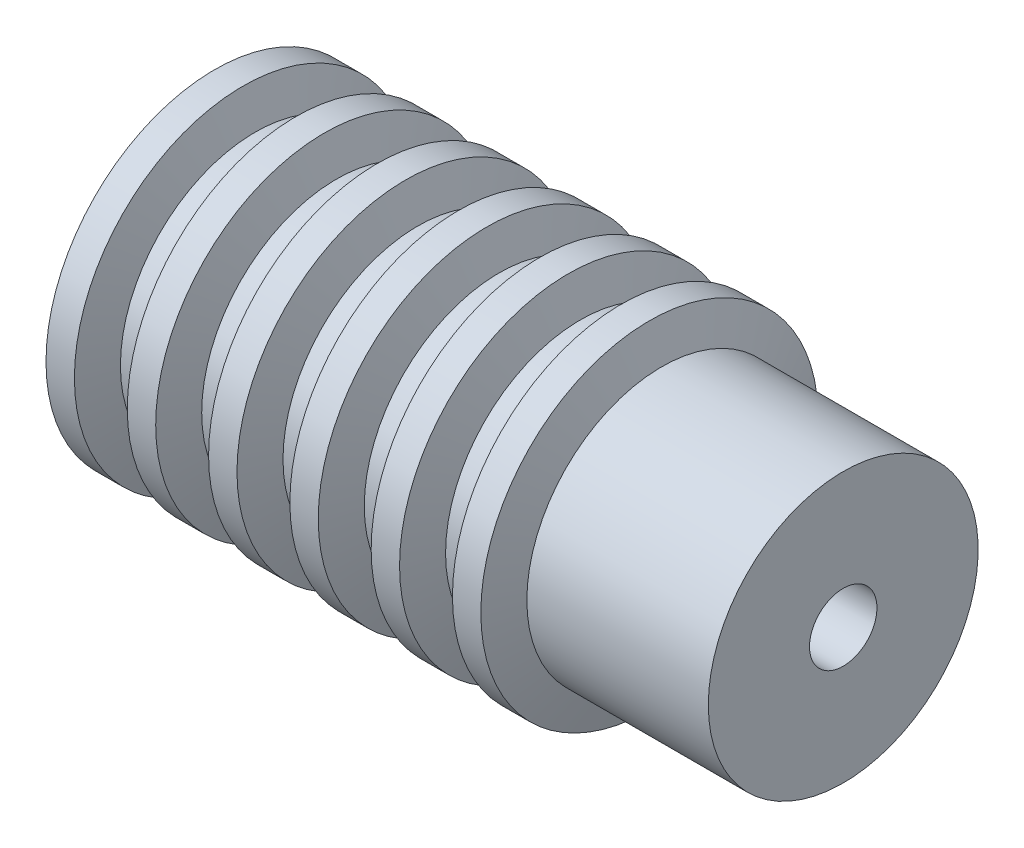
ISO-10303-21;
HEADER;
FILE_DESCRIPTION(('STEP AP214'),'2;1');
FILE_NAME('part.step','',(''),(''),'','','');
FILE_SCHEMA(('AUTOMOTIVE_DESIGN { 1 0 10303 214 1 1 1 1 }'));
ENDSEC;
DATA;
#1=APPLICATION_CONTEXT('core data for automotive mechanical design processes');
#2=APPLICATION_PROTOCOL_DEFINITION('international standard','automotive_design',2000,#1);
#3=PRODUCT_CONTEXT('',#1,'mechanical');
#4=PRODUCT('Part','Part','',(#3));
#5=PRODUCT_RELATED_PRODUCT_CATEGORY('part','',(#4));
#6=PRODUCT_DEFINITION_FORMATION('','',#4);
#7=PRODUCT_DEFINITION_CONTEXT('part definition',#1,'design');
#8=PRODUCT_DEFINITION('design','',#6,#7);
#9=PRODUCT_DEFINITION_SHAPE('','',#8);
#10=(LENGTH_UNIT() NAMED_UNIT(*) SI_UNIT(.MILLI.,.METRE.));
#11=(NAMED_UNIT(*) PLANE_ANGLE_UNIT() SI_UNIT($,.RADIAN.));
#12=(NAMED_UNIT(*) SI_UNIT($,.STERADIAN.) SOLID_ANGLE_UNIT());
#13=UNCERTAINTY_MEASURE_WITH_UNIT(LENGTH_MEASURE(1.E-05),#10,'distance_accuracy_value','');
#14=(GEOMETRIC_REPRESENTATION_CONTEXT(3) GLOBAL_UNCERTAINTY_ASSIGNED_CONTEXT((#13)) GLOBAL_UNIT_ASSIGNED_CONTEXT((#10,
#11,#12)) REPRESENTATION_CONTEXT('',''));
#15=CARTESIAN_POINT('',(0.,0.,0.));
#16=DIRECTION('',(0.,0.,1.));
#17=DIRECTION('',(1.,0.,0.));
#18=AXIS2_PLACEMENT_3D('',#15,#16,#17);
#19=CARTESIAN_POINT('',(0.,0.,0.));
#20=DIRECTION('',(-1.,0.,0.));
#21=DIRECTION('',(0.,0.,1.));
#22=AXIS2_PLACEMENT_3D('',#19,#20,#21);
#23=CYLINDRICAL_SURFACE('',#22,4.);
#24=CARTESIAN_POINT('',(19.,0.,0.));
#25=DIRECTION('',(-1.,0.,0.));
#26=DIRECTION('',(0.,0.,1.));
#27=AXIS2_PLACEMENT_3D('',#24,#25,#26);
#28=CIRCLE('',#27,4.);
#29=CARTESIAN_POINT('',(19.,0.,4.));
#30=VERTEX_POINT('',#29);
#31=EDGE_CURVE('E113',#30,#30,#28,.T.);
#32=ORIENTED_EDGE('',*,*,#31,.T.);
#33=EDGE_LOOP('',(#32));
#34=FACE_BOUND('',#33,.T.);
#35=CARTESIAN_POINT('',(13.62,0.,0.));
#36=DIRECTION('',(-1.,0.,0.));
#37=DIRECTION('',(0.,0.,1.));
#38=AXIS2_PLACEMENT_3D('',#35,#36,#37);
#39=CIRCLE('',#38,4.);
#40=CARTESIAN_POINT('',(13.62,0.,4.));
#41=VERTEX_POINT('',#40);
#42=EDGE_CURVE('E10',#41,#41,#39,.T.);
#43=ORIENTED_EDGE('',*,*,#42,.F.);
#44=EDGE_LOOP('',(#43));
#45=FACE_BOUND('',#44,.T.);
#46=ADVANCED_FACE('F28',(#34,#45),#23,.T.);
#47=CARTESIAN_POINT('',(13.62,0.,0.));
#48=DIRECTION('',(-1.,0.,0.));
#49=DIRECTION('',(0.,0.,1.));
#50=AXIS2_PLACEMENT_3D('',#47,#48,#49);
#51=CONICAL_SURFACE('',#50,4.,1.22173047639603);
#52=CARTESIAN_POINT('',(13.2560297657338,0.,0.));
#53=DIRECTION('',(-1.,0.,0.));
#54=DIRECTION('',(0.,0.,1.));
#55=AXIS2_PLACEMENT_3D('',#52,#53,#54);
#56=CIRCLE('',#55,5.00000000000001);
#57=CARTESIAN_POINT('',(13.2560297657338,0.,5.00000000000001));
#58=VERTEX_POINT('',#57);
#59=EDGE_CURVE('E34',#58,#58,#56,.T.);
#60=ORIENTED_EDGE('',*,*,#59,.F.);
#61=EDGE_LOOP('',(#60));
#62=FACE_BOUND('',#61,.T.);
#63=ORIENTED_EDGE('',*,*,#42,.T.);
#64=EDGE_LOOP('',(#63));
#65=FACE_BOUND('',#64,.T.);
#66=ADVANCED_FACE('F149',(#62,#65),#51,.T.);
#67=CARTESIAN_POINT('',(0.,0.,0.));
#68=DIRECTION('',(-1.,0.,0.));
#69=DIRECTION('',(0.,0.,1.));
#70=AXIS2_PLACEMENT_3D('',#67,#68,#69);
#71=CYLINDRICAL_SURFACE('',#70,5.00000000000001);
#72=CARTESIAN_POINT('',(12.4139702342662,0.,0.));
#73=DIRECTION('',(-1.,0.,0.));
#74=DIRECTION('',(0.,0.,1.));
#75=AXIS2_PLACEMENT_3D('',#72,#73,#74);
#76=CIRCLE('',#75,5.00000000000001);
#77=CARTESIAN_POINT('',(12.4139702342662,0.,5.00000000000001));
#78=VERTEX_POINT('',#77);
#79=EDGE_CURVE('E38',#78,#78,#76,.T.);
#80=ORIENTED_EDGE('',*,*,#79,.F.);
#81=EDGE_LOOP('',(#80));
#82=FACE_BOUND('',#81,.T.);
#83=ORIENTED_EDGE('',*,*,#59,.T.);
#84=EDGE_LOOP('',(#83));
#85=FACE_BOUND('',#84,.T.);
#86=ADVANCED_FACE('F153',(#82,#85),#71,.T.);
#87=CARTESIAN_POINT('',(12.05,0.,0.));
#88=DIRECTION('',(1.,0.,0.));
#89=DIRECTION('',(0.,0.,-1.));
#90=AXIS2_PLACEMENT_3D('',#87,#88,#89);
#91=CONICAL_SURFACE('',#90,4.,1.22173047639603);
#92=ORIENTED_EDGE('',*,*,#79,.T.);
#93=EDGE_LOOP('',(#92));
#94=FACE_BOUND('',#93,.T.);
#95=CARTESIAN_POINT('',(12.05,0.,0.));
#96=DIRECTION('',(-1.,0.,0.));
#97=DIRECTION('',(0.,0.,1.));
#98=AXIS2_PLACEMENT_3D('',#95,#96,#97);
#99=CIRCLE('',#98,4.);
#100=CARTESIAN_POINT('',(12.05,0.,4.));
#101=VERTEX_POINT('',#100);
#102=EDGE_CURVE('E42',#101,#101,#99,.T.);
#103=ORIENTED_EDGE('',*,*,#102,.F.);
#104=EDGE_LOOP('',(#103));
#105=FACE_BOUND('',#104,.T.);
#106=ADVANCED_FACE('F158',(#94,#105),#91,.T.);
#107=CARTESIAN_POINT('',(0.,0.,0.));
#108=DIRECTION('',(-1.,0.,0.));
#109=DIRECTION('',(0.,0.,1.));
#110=AXIS2_PLACEMENT_3D('',#107,#108,#109);
#111=CYLINDRICAL_SURFACE('',#110,4.);
#112=ORIENTED_EDGE('',*,*,#102,.T.);
#113=EDGE_LOOP('',(#112));
#114=FACE_BOUND('',#113,.T.);
#115=CARTESIAN_POINT('',(11.21,0.,0.));
#116=DIRECTION('',(-1.,0.,0.));
#117=DIRECTION('',(0.,0.,1.));
#118=AXIS2_PLACEMENT_3D('',#115,#116,#117);
#119=CIRCLE('',#118,4.);
#120=CARTESIAN_POINT('',(11.21,0.,4.));
#121=VERTEX_POINT('',#120);
#122=EDGE_CURVE('E47',#121,#121,#119,.T.);
#123=ORIENTED_EDGE('',*,*,#122,.F.);
#124=EDGE_LOOP('',(#123));
#125=FACE_BOUND('',#124,.T.);
#126=ADVANCED_FACE('F164',(#114,#125),#111,.T.);
#127=CARTESIAN_POINT('',(11.21,0.,0.));
#128=DIRECTION('',(-1.,0.,0.));
#129=DIRECTION('',(0.,0.,1.));
#130=AXIS2_PLACEMENT_3D('',#127,#128,#129);
#131=CONICAL_SURFACE('',#130,4.,1.22173047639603);
#132=CARTESIAN_POINT('',(10.8460297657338,0.,0.));
#133=DIRECTION('',(-1.,0.,0.));
#134=DIRECTION('',(0.,0.,1.));
#135=AXIS2_PLACEMENT_3D('',#132,#133,#134);
#136=CIRCLE('',#135,5.00000000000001);
#137=CARTESIAN_POINT('',(10.8460297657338,0.,5.00000000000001));
#138=VERTEX_POINT('',#137);
#139=EDGE_CURVE('E50',#138,#138,#136,.T.);
#140=ORIENTED_EDGE('',*,*,#139,.F.);
#141=EDGE_LOOP('',(#140));
#142=FACE_BOUND('',#141,.T.);
#143=ORIENTED_EDGE('',*,*,#122,.T.);
#144=EDGE_LOOP('',(#143));
#145=FACE_BOUND('',#144,.T.);
#146=ADVANCED_FACE('F168',(#142,#145),#131,.T.);
#147=CARTESIAN_POINT('',(0.,0.,0.));
#148=DIRECTION('',(-1.,0.,0.));
#149=DIRECTION('',(0.,0.,1.));
#150=AXIS2_PLACEMENT_3D('',#147,#148,#149);
#151=CYLINDRICAL_SURFACE('',#150,5.00000000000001);
#152=CARTESIAN_POINT('',(10.0039702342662,0.,0.));
#153=DIRECTION('',(-1.,0.,0.));
#154=DIRECTION('',(0.,0.,1.));
#155=AXIS2_PLACEMENT_3D('',#152,#153,#154);
#156=CIRCLE('',#155,5.00000000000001);
#157=CARTESIAN_POINT('',(10.0039702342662,0.,5.00000000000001));
#158=VERTEX_POINT('',#157);
#159=EDGE_CURVE('E53',#158,#158,#156,.T.);
#160=ORIENTED_EDGE('',*,*,#159,.F.);
#161=EDGE_LOOP('',(#160));
#162=FACE_BOUND('',#161,.T.);
#163=ORIENTED_EDGE('',*,*,#139,.T.);
#164=EDGE_LOOP('',(#163));
#165=FACE_BOUND('',#164,.T.);
#166=ADVANCED_FACE('F172',(#162,#165),#151,.T.);
#167=CARTESIAN_POINT('',(9.64,0.,0.));
#168=DIRECTION('',(1.,0.,0.));
#169=DIRECTION('',(0.,0.,-1.));
#170=AXIS2_PLACEMENT_3D('',#167,#168,#169);
#171=CONICAL_SURFACE('',#170,4.,1.22173047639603);
#172=ORIENTED_EDGE('',*,*,#159,.T.);
#173=EDGE_LOOP('',(#172));
#174=FACE_BOUND('',#173,.T.);
#175=CARTESIAN_POINT('',(9.64,0.,0.));
#176=DIRECTION('',(-1.,0.,0.));
#177=DIRECTION('',(0.,0.,1.));
#178=AXIS2_PLACEMENT_3D('',#175,#176,#177);
#179=CIRCLE('',#178,4.);
#180=CARTESIAN_POINT('',(9.64,0.,4.));
#181=VERTEX_POINT('',#180);
#182=EDGE_CURVE('E56',#181,#181,#179,.T.);
#183=ORIENTED_EDGE('',*,*,#182,.F.);
#184=EDGE_LOOP('',(#183));
#185=FACE_BOUND('',#184,.T.);
#186=ADVANCED_FACE('F176',(#174,#185),#171,.T.);
#187=CARTESIAN_POINT('',(0.,0.,0.));
#188=DIRECTION('',(-1.,0.,0.));
#189=DIRECTION('',(0.,0.,1.));
#190=AXIS2_PLACEMENT_3D('',#187,#188,#189);
#191=CYLINDRICAL_SURFACE('',#190,4.);
#192=ORIENTED_EDGE('',*,*,#182,.T.);
#193=EDGE_LOOP('',(#192));
#194=FACE_BOUND('',#193,.T.);
#195=CARTESIAN_POINT('',(8.8,0.,0.));
#196=DIRECTION('',(-1.,0.,0.));
#197=DIRECTION('',(0.,0.,1.));
#198=AXIS2_PLACEMENT_3D('',#195,#196,#197);
#199=CIRCLE('',#198,4.);
#200=CARTESIAN_POINT('',(8.8,0.,4.));
#201=VERTEX_POINT('',#200);
#202=EDGE_CURVE('E59',#201,#201,#199,.T.);
#203=ORIENTED_EDGE('',*,*,#202,.F.);
#204=EDGE_LOOP('',(#203));
#205=FACE_BOUND('',#204,.T.);
#206=ADVANCED_FACE('F180',(#194,#205),#191,.T.);
#207=CARTESIAN_POINT('',(8.8,0.,0.));
#208=DIRECTION('',(-1.,0.,0.));
#209=DIRECTION('',(0.,0.,1.));
#210=AXIS2_PLACEMENT_3D('',#207,#208,#209);
#211=CONICAL_SURFACE('',#210,4.,1.22173047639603);
#212=CARTESIAN_POINT('',(8.4360297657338,0.,0.));
#213=DIRECTION('',(-1.,0.,0.));
#214=DIRECTION('',(0.,0.,1.));
#215=AXIS2_PLACEMENT_3D('',#212,#213,#214);
#216=CIRCLE('',#215,5.);
#217=CARTESIAN_POINT('',(8.4360297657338,0.,5.));
#218=VERTEX_POINT('',#217);
#219=EDGE_CURVE('E62',#218,#218,#216,.T.);
#220=ORIENTED_EDGE('',*,*,#219,.F.);
#221=EDGE_LOOP('',(#220));
#222=FACE_BOUND('',#221,.T.);
#223=ORIENTED_EDGE('',*,*,#202,.T.);
#224=EDGE_LOOP('',(#223));
#225=FACE_BOUND('',#224,.T.);
#226=ADVANCED_FACE('F184',(#222,#225),#211,.T.);
#227=CARTESIAN_POINT('',(0.,0.,0.));
#228=DIRECTION('',(-1.,0.,0.));
#229=DIRECTION('',(0.,0.,1.));
#230=AXIS2_PLACEMENT_3D('',#227,#228,#229);
#231=CYLINDRICAL_SURFACE('',#230,5.);
#232=CARTESIAN_POINT('',(7.5939702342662,0.,0.));
#233=DIRECTION('',(-1.,0.,0.));
#234=DIRECTION('',(0.,0.,1.));
#235=AXIS2_PLACEMENT_3D('',#232,#233,#234);
#236=CIRCLE('',#235,5.);
#237=CARTESIAN_POINT('',(7.5939702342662,0.,5.));
#238=VERTEX_POINT('',#237);
#239=EDGE_CURVE('E65',#238,#238,#236,.T.);
#240=ORIENTED_EDGE('',*,*,#239,.F.);
#241=EDGE_LOOP('',(#240));
#242=FACE_BOUND('',#241,.T.);
#243=ORIENTED_EDGE('',*,*,#219,.T.);
#244=EDGE_LOOP('',(#243));
#245=FACE_BOUND('',#244,.T.);
#246=ADVANCED_FACE('F188',(#242,#245),#231,.T.);
#247=CARTESIAN_POINT('',(7.23,0.,0.));
#248=DIRECTION('',(1.,0.,0.));
#249=DIRECTION('',(0.,0.,-1.));
#250=AXIS2_PLACEMENT_3D('',#247,#248,#249);
#251=CONICAL_SURFACE('',#250,4.,1.22173047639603);
#252=ORIENTED_EDGE('',*,*,#239,.T.);
#253=EDGE_LOOP('',(#252));
#254=FACE_BOUND('',#253,.T.);
#255=CARTESIAN_POINT('',(7.23,0.,0.));
#256=DIRECTION('',(-1.,0.,0.));
#257=DIRECTION('',(0.,0.,1.));
#258=AXIS2_PLACEMENT_3D('',#255,#256,#257);
#259=CIRCLE('',#258,4.);
#260=CARTESIAN_POINT('',(7.23,0.,4.));
#261=VERTEX_POINT('',#260);
#262=EDGE_CURVE('E68',#261,#261,#259,.T.);
#263=ORIENTED_EDGE('',*,*,#262,.F.);
#264=EDGE_LOOP('',(#263));
#265=FACE_BOUND('',#264,.T.);
#266=ADVANCED_FACE('F192',(#254,#265),#251,.T.);
#267=CARTESIAN_POINT('',(0.,0.,0.));
#268=DIRECTION('',(-1.,0.,0.));
#269=DIRECTION('',(0.,0.,1.));
#270=AXIS2_PLACEMENT_3D('',#267,#268,#269);
#271=CYLINDRICAL_SURFACE('',#270,4.);
#272=ORIENTED_EDGE('',*,*,#262,.T.);
#273=EDGE_LOOP('',(#272));
#274=FACE_BOUND('',#273,.T.);
#275=CARTESIAN_POINT('',(6.39,0.,0.));
#276=DIRECTION('',(-1.,0.,0.));
#277=DIRECTION('',(0.,0.,1.));
#278=AXIS2_PLACEMENT_3D('',#275,#276,#277);
#279=CIRCLE('',#278,4.);
#280=CARTESIAN_POINT('',(6.39,0.,4.));
#281=VERTEX_POINT('',#280);
#282=EDGE_CURVE('E71',#281,#281,#279,.T.);
#283=ORIENTED_EDGE('',*,*,#282,.F.);
#284=EDGE_LOOP('',(#283));
#285=FACE_BOUND('',#284,.T.);
#286=ADVANCED_FACE('F196',(#274,#285),#271,.T.);
#287=CARTESIAN_POINT('',(6.39,0.,0.));
#288=DIRECTION('',(-1.,0.,0.));
#289=DIRECTION('',(0.,0.,1.));
#290=AXIS2_PLACEMENT_3D('',#287,#288,#289);
#291=CONICAL_SURFACE('',#290,4.,1.22173047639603);
#292=CARTESIAN_POINT('',(6.02602976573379,0.,0.));
#293=DIRECTION('',(-1.,0.,0.));
#294=DIRECTION('',(0.,0.,1.));
#295=AXIS2_PLACEMENT_3D('',#292,#293,#294);
#296=CIRCLE('',#295,5.00000000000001);
#297=CARTESIAN_POINT('',(6.02602976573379,0.,5.00000000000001));
#298=VERTEX_POINT('',#297);
#299=EDGE_CURVE('E74',#298,#298,#296,.T.);
#300=ORIENTED_EDGE('',*,*,#299,.F.);
#301=EDGE_LOOP('',(#300));
#302=FACE_BOUND('',#301,.T.);
#303=ORIENTED_EDGE('',*,*,#282,.T.);
#304=EDGE_LOOP('',(#303));
#305=FACE_BOUND('',#304,.T.);
#306=ADVANCED_FACE('F200',(#302,#305),#291,.T.);
#307=CARTESIAN_POINT('',(0.,0.,0.));
#308=DIRECTION('',(-1.,0.,0.));
#309=DIRECTION('',(0.,0.,1.));
#310=AXIS2_PLACEMENT_3D('',#307,#308,#309);
#311=CYLINDRICAL_SURFACE('',#310,5.00000000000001);
#312=CARTESIAN_POINT('',(5.1839702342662,0.,0.));
#313=DIRECTION('',(-1.,0.,0.));
#314=DIRECTION('',(0.,0.,1.));
#315=AXIS2_PLACEMENT_3D('',#312,#313,#314);
#316=CIRCLE('',#315,5.);
#317=CARTESIAN_POINT('',(5.1839702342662,0.,5.));
#318=VERTEX_POINT('',#317);
#319=EDGE_CURVE('E77',#318,#318,#316,.T.);
#320=ORIENTED_EDGE('',*,*,#319,.F.);
#321=EDGE_LOOP('',(#320));
#322=FACE_BOUND('',#321,.T.);
#323=ORIENTED_EDGE('',*,*,#299,.T.);
#324=EDGE_LOOP('',(#323));
#325=FACE_BOUND('',#324,.T.);
#326=ADVANCED_FACE('F204',(#322,#325),#311,.T.);
#327=CARTESIAN_POINT('',(4.82,0.,0.));
#328=DIRECTION('',(1.,0.,0.));
#329=DIRECTION('',(0.,0.,-1.));
#330=AXIS2_PLACEMENT_3D('',#327,#328,#329);
#331=CONICAL_SURFACE('',#330,4.,1.22173047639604);
#332=ORIENTED_EDGE('',*,*,#319,.T.);
#333=EDGE_LOOP('',(#332));
#334=FACE_BOUND('',#333,.T.);
#335=CARTESIAN_POINT('',(4.82,0.,0.));
#336=DIRECTION('',(-1.,0.,0.));
#337=DIRECTION('',(0.,0.,1.));
#338=AXIS2_PLACEMENT_3D('',#335,#336,#337);
#339=CIRCLE('',#338,4.);
#340=CARTESIAN_POINT('',(4.82,0.,4.));
#341=VERTEX_POINT('',#340);
#342=EDGE_CURVE('E80',#341,#341,#339,.T.);
#343=ORIENTED_EDGE('',*,*,#342,.F.);
#344=EDGE_LOOP('',(#343));
#345=FACE_BOUND('',#344,.T.);
#346=ADVANCED_FACE('F208',(#334,#345),#331,.T.);
#347=CARTESIAN_POINT('',(0.,0.,0.));
#348=DIRECTION('',(-1.,0.,0.));
#349=DIRECTION('',(0.,0.,1.));
#350=AXIS2_PLACEMENT_3D('',#347,#348,#349);
#351=CYLINDRICAL_SURFACE('',#350,4.);
#352=ORIENTED_EDGE('',*,*,#342,.T.);
#353=EDGE_LOOP('',(#352));
#354=FACE_BOUND('',#353,.T.);
#355=CARTESIAN_POINT('',(3.98,0.,0.));
#356=DIRECTION('',(-1.,0.,0.));
#357=DIRECTION('',(0.,0.,1.));
#358=AXIS2_PLACEMENT_3D('',#355,#356,#357);
#359=CIRCLE('',#358,4.);
#360=CARTESIAN_POINT('',(3.98,0.,4.));
#361=VERTEX_POINT('',#360);
#362=EDGE_CURVE('E83',#361,#361,#359,.T.);
#363=ORIENTED_EDGE('',*,*,#362,.F.);
#364=EDGE_LOOP('',(#363));
#365=FACE_BOUND('',#364,.T.);
#366=ADVANCED_FACE('F212',(#354,#365),#351,.T.);
#367=CARTESIAN_POINT('',(3.98,0.,0.));
#368=DIRECTION('',(-1.,0.,0.));
#369=DIRECTION('',(0.,0.,1.));
#370=AXIS2_PLACEMENT_3D('',#367,#368,#369);
#371=CONICAL_SURFACE('',#370,4.,1.22173047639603);
#372=CARTESIAN_POINT('',(3.61602976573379,0.,0.));
#373=DIRECTION('',(-1.,0.,0.));
#374=DIRECTION('',(0.,0.,1.));
#375=AXIS2_PLACEMENT_3D('',#372,#373,#374);
#376=CIRCLE('',#375,5.00000000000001);
#377=CARTESIAN_POINT('',(3.61602976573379,0.,5.00000000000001));
#378=VERTEX_POINT('',#377);
#379=EDGE_CURVE('E86',#378,#378,#376,.T.);
#380=ORIENTED_EDGE('',*,*,#379,.F.);
#381=EDGE_LOOP('',(#380));
#382=FACE_BOUND('',#381,.T.);
#383=ORIENTED_EDGE('',*,*,#362,.T.);
#384=EDGE_LOOP('',(#383));
#385=FACE_BOUND('',#384,.T.);
#386=ADVANCED_FACE('F216',(#382,#385),#371,.T.);
#387=CARTESIAN_POINT('',(0.,0.,0.));
#388=DIRECTION('',(-1.,0.,0.));
#389=DIRECTION('',(0.,0.,1.));
#390=AXIS2_PLACEMENT_3D('',#387,#388,#389);
#391=CYLINDRICAL_SURFACE('',#390,5.00000000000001);
#392=CARTESIAN_POINT('',(2.7739702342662,0.,0.));
#393=DIRECTION('',(-1.,0.,0.));
#394=DIRECTION('',(0.,0.,1.));
#395=AXIS2_PLACEMENT_3D('',#392,#393,#394);
#396=CIRCLE('',#395,5.);
#397=CARTESIAN_POINT('',(2.7739702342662,0.,5.));
#398=VERTEX_POINT('',#397);
#399=EDGE_CURVE('E89',#398,#398,#396,.T.);
#400=ORIENTED_EDGE('',*,*,#399,.F.);
#401=EDGE_LOOP('',(#400));
#402=FACE_BOUND('',#401,.T.);
#403=ORIENTED_EDGE('',*,*,#379,.T.);
#404=EDGE_LOOP('',(#403));
#405=FACE_BOUND('',#404,.T.);
#406=ADVANCED_FACE('F220',(#402,#405),#391,.T.);
#407=CARTESIAN_POINT('',(2.41,0.,0.));
#408=DIRECTION('',(1.,0.,0.));
#409=DIRECTION('',(0.,0.,-1.));
#410=AXIS2_PLACEMENT_3D('',#407,#408,#409);
#411=CONICAL_SURFACE('',#410,4.,1.22173047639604);
#412=ORIENTED_EDGE('',*,*,#399,.T.);
#413=EDGE_LOOP('',(#412));
#414=FACE_BOUND('',#413,.T.);
#415=CARTESIAN_POINT('',(2.41,0.,0.));
#416=DIRECTION('',(-1.,0.,0.));
#417=DIRECTION('',(0.,0.,1.));
#418=AXIS2_PLACEMENT_3D('',#415,#416,#417);
#419=CIRCLE('',#418,4.);
#420=CARTESIAN_POINT('',(2.41,0.,4.));
#421=VERTEX_POINT('',#420);
#422=EDGE_CURVE('E92',#421,#421,#419,.T.);
#423=ORIENTED_EDGE('',*,*,#422,.F.);
#424=EDGE_LOOP('',(#423));
#425=FACE_BOUND('',#424,.T.);
#426=ADVANCED_FACE('F224',(#414,#425),#411,.T.);
#427=CARTESIAN_POINT('',(0.,0.,0.));
#428=DIRECTION('',(-1.,0.,0.));
#429=DIRECTION('',(0.,0.,1.));
#430=AXIS2_PLACEMENT_3D('',#427,#428,#429);
#431=CYLINDRICAL_SURFACE('',#430,4.);
#432=ORIENTED_EDGE('',*,*,#422,.T.);
#433=EDGE_LOOP('',(#432));
#434=FACE_BOUND('',#433,.T.);
#435=CARTESIAN_POINT('',(1.57,0.,0.));
#436=DIRECTION('',(-1.,0.,0.));
#437=DIRECTION('',(0.,0.,1.));
#438=AXIS2_PLACEMENT_3D('',#435,#436,#437);
#439=CIRCLE('',#438,4.);
#440=CARTESIAN_POINT('',(1.57,0.,4.));
#441=VERTEX_POINT('',#440);
#442=EDGE_CURVE('E95',#441,#441,#439,.T.);
#443=ORIENTED_EDGE('',*,*,#442,.F.);
#444=EDGE_LOOP('',(#443));
#445=FACE_BOUND('',#444,.T.);
#446=ADVANCED_FACE('F228',(#434,#445),#431,.T.);
#447=CARTESIAN_POINT('',(1.57,0.,0.));
#448=DIRECTION('',(-1.,0.,0.));
#449=DIRECTION('',(0.,0.,1.));
#450=AXIS2_PLACEMENT_3D('',#447,#448,#449);
#451=CONICAL_SURFACE('',#450,4.,1.22173047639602);
#452=CARTESIAN_POINT('',(1.20602976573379,0.,0.));
#453=DIRECTION('',(-1.,0.,0.));
#454=DIRECTION('',(0.,0.,1.));
#455=AXIS2_PLACEMENT_3D('',#452,#453,#454);
#456=CIRCLE('',#455,5.);
#457=CARTESIAN_POINT('',(1.20602976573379,0.,5.));
#458=VERTEX_POINT('',#457);
#459=EDGE_CURVE('E98',#458,#458,#456,.T.);
#460=ORIENTED_EDGE('',*,*,#459,.F.);
#461=EDGE_LOOP('',(#460));
#462=FACE_BOUND('',#461,.T.);
#463=ORIENTED_EDGE('',*,*,#442,.T.);
#464=EDGE_LOOP('',(#463));
#465=FACE_BOUND('',#464,.T.);
#466=ADVANCED_FACE('F145',(#462,#465),#451,.T.);
#467=CARTESIAN_POINT('',(0.,0.,0.));
#468=DIRECTION('',(-1.,0.,0.));
#469=DIRECTION('',(0.,0.,1.));
#470=AXIS2_PLACEMENT_3D('',#467,#468,#469);
#471=CYLINDRICAL_SURFACE('',#470,5.);
#472=CARTESIAN_POINT('',(0.363970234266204,0.,0.));
#473=DIRECTION('',(-1.,0.,0.));
#474=DIRECTION('',(0.,0.,1.));
#475=AXIS2_PLACEMENT_3D('',#472,#473,#474);
#476=CIRCLE('',#475,5.);
#477=CARTESIAN_POINT('',(0.363970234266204,0.,5.));
#478=VERTEX_POINT('',#477);
#479=EDGE_CURVE('E101',#478,#478,#476,.T.);
#480=ORIENTED_EDGE('',*,*,#479,.F.);
#481=EDGE_LOOP('',(#480));
#482=FACE_BOUND('',#481,.T.);
#483=ORIENTED_EDGE('',*,*,#459,.T.);
#484=EDGE_LOOP('',(#483));
#485=FACE_BOUND('',#484,.T.);
#486=ADVANCED_FACE('F139',(#482,#485),#471,.T.);
#487=CARTESIAN_POINT('',(0.,0.,0.));
#488=DIRECTION('',(1.,0.,0.));
#489=DIRECTION('',(0.,0.,-1.));
#490=AXIS2_PLACEMENT_3D('',#487,#488,#489);
#491=CONICAL_SURFACE('',#490,4.,1.22173047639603);
#492=ORIENTED_EDGE('',*,*,#479,.T.);
#493=EDGE_LOOP('',(#492));
#494=FACE_BOUND('',#493,.T.);
#495=CARTESIAN_POINT('',(0.,0.,0.));
#496=DIRECTION('',(-1.,0.,0.));
#497=DIRECTION('',(0.,0.,1.));
#498=AXIS2_PLACEMENT_3D('',#495,#496,#497);
#499=CIRCLE('',#498,4.);
#500=CARTESIAN_POINT('',(0.,0.,4.));
#501=VERTEX_POINT('',#500);
#502=EDGE_CURVE('E104',#501,#501,#499,.T.);
#503=ORIENTED_EDGE('',*,*,#502,.F.);
#504=EDGE_LOOP('',(#503));
#505=FACE_BOUND('',#504,.T.);
#506=ADVANCED_FACE('F134',(#494,#505),#491,.T.);
#507=CARTESIAN_POINT('',(0.,-12.9231097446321,0.));
#508=DIRECTION('',(1.,0.,0.));
#509=DIRECTION('',(0.,0.,-1.));
#510=AXIS2_PLACEMENT_3D('',#507,#508,#509);
#511=PLANE('',#510);
#512=CARTESIAN_POINT('',(0.,0.,0.));
#513=DIRECTION('',(-1.,0.,0.));
#514=DIRECTION('',(0.,0.,1.));
#515=AXIS2_PLACEMENT_3D('',#512,#513,#514);
#516=CIRCLE('',#515,0.999999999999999);
#517=CARTESIAN_POINT('',(0.,0.,0.999999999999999));
#518=VERTEX_POINT('',#517);
#519=EDGE_CURVE('E107',#518,#518,#516,.T.);
#520=ORIENTED_EDGE('',*,*,#519,.F.);
#521=EDGE_LOOP('',(#520));
#522=FACE_BOUND('',#521,.T.);
#523=ORIENTED_EDGE('',*,*,#502,.T.);
#524=EDGE_LOOP('',(#523));
#525=FACE_BOUND('',#524,.T.);
#526=ADVANCED_FACE('F128',(#522,#525),#511,.F.);
#527=CARTESIAN_POINT('',(0.,0.,0.));
#528=DIRECTION('',(-1.,0.,0.));
#529=DIRECTION('',(0.,0.,1.));
#530=AXIS2_PLACEMENT_3D('',#527,#528,#529);
#531=CYLINDRICAL_SURFACE('',#530,1.);
#532=CARTESIAN_POINT('',(19.,0.,0.));
#533=DIRECTION('',(-1.,0.,0.));
#534=DIRECTION('',(0.,0.,1.));
#535=AXIS2_PLACEMENT_3D('',#532,#533,#534);
#536=CIRCLE('',#535,1.);
#537=CARTESIAN_POINT('',(19.,0.,1.));
#538=VERTEX_POINT('',#537);
#539=EDGE_CURVE('E110',#538,#538,#536,.T.);
#540=ORIENTED_EDGE('',*,*,#539,.F.);
#541=EDGE_LOOP('',(#540));
#542=FACE_BOUND('',#541,.T.);
#543=ORIENTED_EDGE('',*,*,#519,.T.);
#544=EDGE_LOOP('',(#543));
#545=FACE_BOUND('',#544,.T.);
#546=ADVANCED_FACE('F122',(#542,#545),#531,.F.);
#547=CARTESIAN_POINT('',(19.,-12.9231097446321,0.));
#548=DIRECTION('',(-1.,0.,0.));
#549=DIRECTION('',(0.,0.,1.));
#550=AXIS2_PLACEMENT_3D('',#547,#548,#549);
#551=PLANE('',#550);
#552=ORIENTED_EDGE('',*,*,#31,.F.);
#553=EDGE_LOOP('',(#552));
#554=FACE_BOUND('',#553,.T.);
#555=ORIENTED_EDGE('',*,*,#539,.T.);
#556=EDGE_LOOP('',(#555));
#557=FACE_BOUND('',#556,.T.);
#558=ADVANCED_FACE('F119',(#554,#557),#551,.F.);
#559=CLOSED_SHELL('',(#46,#66,#86,#106,#126,#146,#166,#186,#206,#226,#246,#266,#286,#306,#326,
#346,#366,#386,#406,#426,#446,#466,#486,#506,#526,#546,#558));
#560=MANIFOLD_SOLID_BREP('B2',#559);
#561=ADVANCED_BREP_SHAPE_REPRESENTATION('',(#18,#560),#14);
#562=SHAPE_DEFINITION_REPRESENTATION(#9,#561);
ENDSEC;
END-ISO-10303-21;
